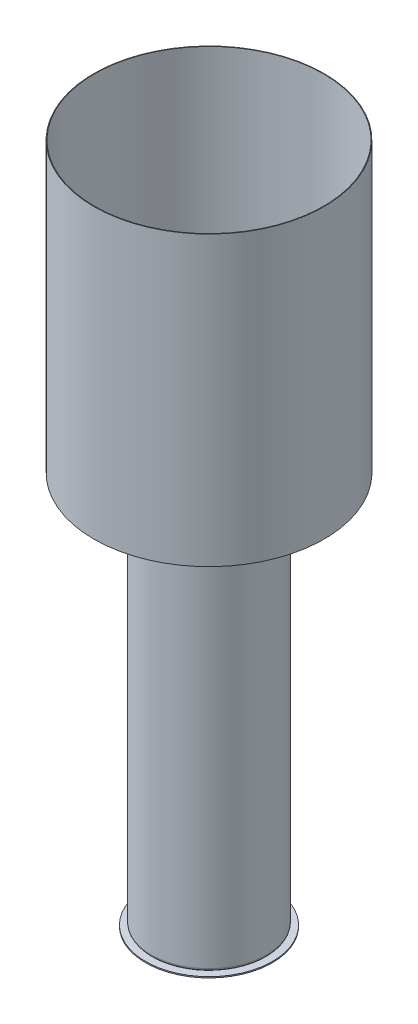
from build123d import *

# Parameters (mm, degrees)
CROQUIS1_R                   = 100
SALIENTE_EXTRUIR1_DEPTH      = 700
VACIADO1_T                   = -15
REDONDEO1_R                  = 10
CROQUIS3_R                   = 5
CORTAR_EXTRUIR1_DEPTH        = 600
REDONDEO2_R                  = 5
CROQUIS4_R                   = 10
SALIENTE_EXTRUIR2_DEPTH      = 20
SALIENTE_EXTRUIR3_DEPTH      = 460
SALIENTE_EXTRUIR3_DEPTH_BACK = 40
CROQUIS5_R                   = 200
CROQUIS5_R_2                 = 199
CROQUIS6_R                   = 110
SALIENTE_EXTRUIR4_DEPTH      = 2


with BuildPart() as part:
    # Croquis1 → Saliente-Extruir1 (new body)
    with BuildSketch(Plane(origin=(0, 0, 0), x_dir=(1, 0, 0), z_dir=(0, 1, 0))):
        with Locations(Location((0, 0, 0), (0, 0, 270))):
            Circle(CROQUIS1_R)
    extrude(amount=SALIENTE_EXTRUIR1_DEPTH)

    # Vaciado1
    vaciado1_openings = [part.faces().sort_by_distance(p)[0] for p in [
        (0, 0, 0),
    ]]
    offset(amount=VACIADO1_T, openings=vaciado1_openings, kind=Kind.INTERSECTION)

    # Redondeo1
    redondeo1_edges = [part.edges().sort_by_distance(p)[0] for p in [
        (0, 700, -100),
    ]]
    fillet(redondeo1_edges, radius=REDONDEO1_R)

    # Croquis3 → Cortar-Extruir1 (cut)
    with BuildSketch(Plane(origin=(0, 700, 0), x_dir=(1, 0, 0), z_dir=(0, 1, 0))):
        with Locations(Location((0, 0, 0), (0, 0, 270))):
            Circle(CROQUIS3_R)
    extrude(amount=-CORTAR_EXTRUIR1_DEPTH, mode=Mode.SUBTRACT)

    # Redondeo2
    redondeo2_edges = [part.edges().sort_by_distance(p)[0] for p in [
        (0, 0, -100),
    ]]
    fillet(redondeo2_edges, radius=REDONDEO2_R)


with BuildPart() as body_2:
    # Croquis4 → Saliente-Extruir2 (new body)
    with BuildSketch(Plane(origin=(0, 700, 0), x_dir=(1, 0, 0), z_dir=(0, 1, 0))):
        with Locations(Location((0, 0, 0), (0, 0, 270))):
            Circle(CROQUIS4_R)
    extrude(amount=SALIENTE_EXTRUIR2_DEPTH)


with BuildPart() as body_3:
    # Croquis5 → Saliente-Extruir3 (new, two sides: drawn at the far end of the back side and taken through both)
    with BuildSketch(Plane(origin=(0, 720, 0), x_dir=(1, 0, 0), z_dir=(0, 1, 0)).offset(-SALIENTE_EXTRUIR3_DEPTH_BACK)):
        with Locations(Location((0, 0, 0), (0, 0, 270))):
            Circle(CROQUIS5_R)
        with Locations(Location((0, 0, 0), (0, 0, 270))):
            Circle(CROQUIS5_R_2, mode=Mode.SUBTRACT)
    extrude(amount=SALIENTE_EXTRUIR3_DEPTH + SALIENTE_EXTRUIR3_DEPTH_BACK)


with BuildPart() as body_4:
    # Croquis6 → Saliente-Extruir4 (new body)
    with BuildSketch(Plane.XZ):
        with Locations(Location((0, 0, 0), (0, 0, 270))):
            Circle(CROQUIS6_R)
    extrude(amount=SALIENTE_EXTRUIR4_DEPTH)


solid = Compound([part.part, body_2.part, body_3.part, body_4.part])
